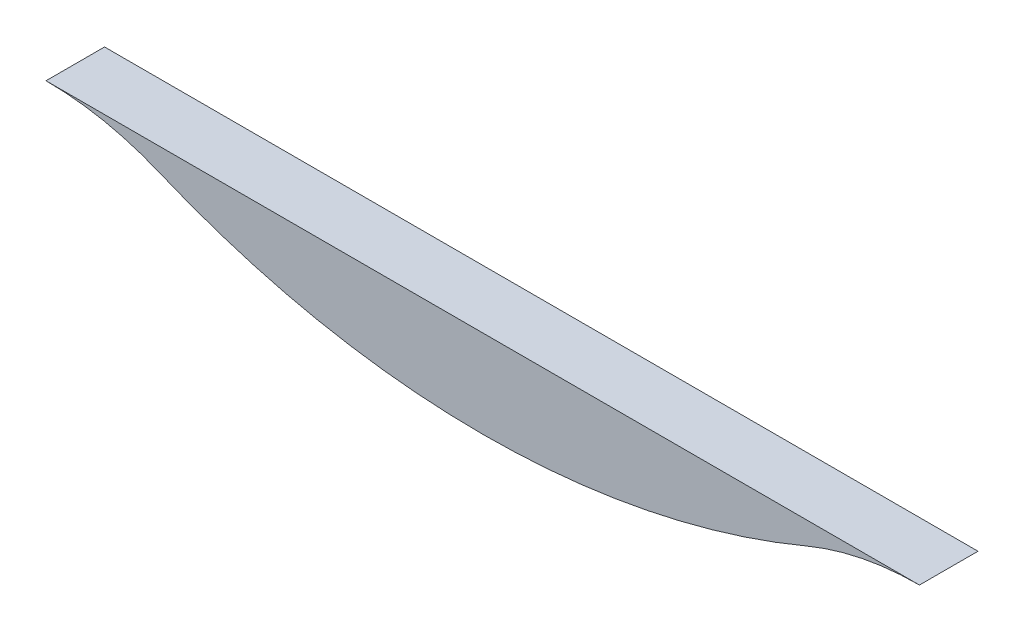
from build123d import *

# Parameters (mm, degrees)
SKETCH1_W           = 86.926834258
SKETCH1_H           = 6.720778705
BASE_EXTRUDE_DEPTH  = 20
BOSS_EXTRUDE1_DEPTH = 1
FILLET1_R           = 10
SKETCH3_W           = 40
SKETCH3_H           = 6.720778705
CUT_EXTRUDE1_DEPTH  = 90.450787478


with BuildPart() as part:
    # Sketch1 → Base-Extrude (new, symmetric)
    with BuildSketch(Plane.XY):
        with Locations((0, 3.360389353)):
            Rectangle(SKETCH1_W, SKETCH1_H)
    extrude(amount=BASE_EXTRUDE_DEPTH, both=True)

    # Sketch2 → Boss-Extrude1 (add, symmetric)
    with BuildSketch(Plane.XY):
        with BuildLine():
            Line((-12.75, 0), (12.75, 0))
            ThreePointArc((12.75, 0), (0, -3), (-12.75, 0))
        make_face()
    extrude(amount=BOSS_EXTRUDE1_DEPTH, both=True)

    # Fillet1
    fillet1_edges = [part.edges().sort_by_distance(p)[0] for p in [
        (-12.75, 0, 0),
        (12.75, 0, 0),
    ]]
    fillet(fillet1_edges, radius=FILLET1_R)

    # Sketch3 → Cut-Extrude1 (cut, through all)
    with BuildSketch(Plane(origin=(43.463417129, 0, 0), x_dir=(0, 0, -1), z_dir=(1, 0, 0))):
        with Locations((0, 3.360389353)):
            Rectangle(SKETCH3_W, SKETCH3_H)
    extrude(amount=-CUT_EXTRUDE1_DEPTH, mode=Mode.SUBTRACT)


solid = part.part
